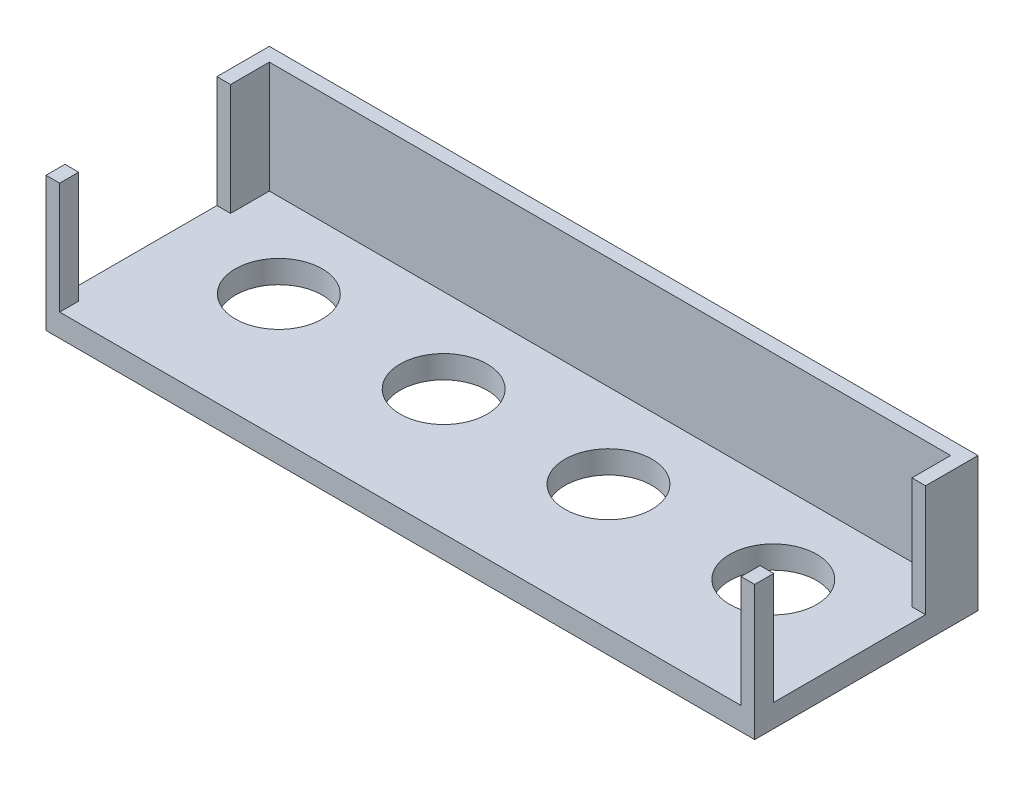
ISO-10303-21;
HEADER;
FILE_DESCRIPTION(('STEP AP214'),'2;1');
FILE_NAME('part.step','',(''),(''),'','','');
FILE_SCHEMA(('AUTOMOTIVE_DESIGN { 1 0 10303 214 1 1 1 1 }'));
ENDSEC;
DATA;
#1=APPLICATION_CONTEXT('core data for automotive mechanical design processes');
#2=APPLICATION_PROTOCOL_DEFINITION('international standard','automotive_design',2000,#1);
#3=PRODUCT_CONTEXT('',#1,'mechanical');
#4=PRODUCT('Part','Part','',(#3));
#5=PRODUCT_RELATED_PRODUCT_CATEGORY('part','',(#4));
#6=PRODUCT_DEFINITION_FORMATION('','',#4);
#7=PRODUCT_DEFINITION_CONTEXT('part definition',#1,'design');
#8=PRODUCT_DEFINITION('design','',#6,#7);
#9=PRODUCT_DEFINITION_SHAPE('','',#8);
#10=(LENGTH_UNIT() NAMED_UNIT(*) SI_UNIT(.MILLI.,.METRE.));
#11=(NAMED_UNIT(*) PLANE_ANGLE_UNIT() SI_UNIT($,.RADIAN.));
#12=(NAMED_UNIT(*) SI_UNIT($,.STERADIAN.) SOLID_ANGLE_UNIT());
#13=UNCERTAINTY_MEASURE_WITH_UNIT(LENGTH_MEASURE(1.E-05),#10,'distance_accuracy_value','');
#14=(GEOMETRIC_REPRESENTATION_CONTEXT(3) GLOBAL_UNCERTAINTY_ASSIGNED_CONTEXT((#13)) GLOBAL_UNIT_ASSIGNED_CONTEXT((#10,
#11,#12)) REPRESENTATION_CONTEXT('',''));
#15=CARTESIAN_POINT('',(0.,0.,0.));
#16=DIRECTION('',(0.,0.,1.));
#17=DIRECTION('',(1.,0.,0.));
#18=AXIS2_PLACEMENT_3D('',#15,#16,#17);
#19=CARTESIAN_POINT('',(0.,17.7,0.));
#20=DIRECTION('',(0.,-1.,0.));
#21=DIRECTION('',(0.,0.,-1.));
#22=AXIS2_PLACEMENT_3D('',#19,#20,#21);
#23=PLANE('',#22);
#24=DIRECTION('',(0.,0.,1.));
#25=VECTOR('',#24,1.);
#26=CARTESIAN_POINT('',(-0.200000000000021,17.7,-55.));
#27=LINE('',#26,#25);
#28=CARTESIAN_POINT('',(-0.20000000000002,17.7,-29.9));
#29=VERTEX_POINT('',#28);
#30=CARTESIAN_POINT('',(-0.20000000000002,17.7,-27.4));
#31=VERTEX_POINT('',#30);
#32=EDGE_CURVE('E347',#29,#31,#27,.T.);
#33=ORIENTED_EDGE('',*,*,#32,.F.);
#34=DIRECTION('',(-1.,0.,0.));
#35=VECTOR('',#34,1.);
#36=CARTESIAN_POINT('',(0.,17.7,-29.9));
#37=LINE('',#36,#35);
#38=CARTESIAN_POINT('',(-2.00000000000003,17.7,-29.9));
#39=VERTEX_POINT('',#38);
#40=EDGE_CURVE('E324',#29,#39,#37,.T.);
#41=ORIENTED_EDGE('',*,*,#40,.T.);
#42=DIRECTION('',(0.,0.,1.));
#43=VECTOR('',#42,1.);
#44=CARTESIAN_POINT('',(-2.00000000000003,17.7,-56.8));
#45=LINE('',#44,#43);
#46=CARTESIAN_POINT('',(-2.00000000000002,17.7,-27.4));
#47=VERTEX_POINT('',#46);
#48=EDGE_CURVE('E195',#39,#47,#45,.T.);
#49=ORIENTED_EDGE('',*,*,#48,.T.);
#50=DIRECTION('',(-1.,0.,0.));
#51=VECTOR('',#50,1.);
#52=CARTESIAN_POINT('',(-2.00000000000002,17.7,-27.4));
#53=LINE('',#52,#51);
#54=EDGE_CURVE('E277',#31,#47,#53,.T.);
#55=ORIENTED_EDGE('',*,*,#54,.F.);
#56=EDGE_LOOP('',(#33,#41,#49,#55));
#57=FACE_BOUND('',#56,.T.);
#58=ADVANCED_FACE('F45',(#57),#23,.F.);
#59=DIRECTION('',(0.,0.,-1.));
#60=VECTOR('',#59,1.);
#61=CARTESIAN_POINT('',(91.3,17.7,-56.8));
#62=LINE('',#61,#60);
#63=CARTESIAN_POINT('',(91.3,17.7,-27.4));
#64=VERTEX_POINT('',#63);
#65=CARTESIAN_POINT('',(91.3,17.7,-29.9));
#66=VERTEX_POINT('',#65);
#67=EDGE_CURVE('E189',#64,#66,#62,.T.);
#68=ORIENTED_EDGE('',*,*,#67,.T.);
#69=CARTESIAN_POINT('',(89.5,17.7,-29.9));
#70=VERTEX_POINT('',#69);
#71=EDGE_CURVE('E268',#66,#70,#37,.T.);
#72=ORIENTED_EDGE('',*,*,#71,.T.);
#73=DIRECTION('',(0.,0.,-1.));
#74=VECTOR('',#73,1.);
#75=CARTESIAN_POINT('',(89.5,17.7,-55.));
#76=LINE('',#75,#74);
#77=CARTESIAN_POINT('',(89.5,17.7,-27.4));
#78=VERTEX_POINT('',#77);
#79=EDGE_CURVE('E256',#78,#70,#76,.T.);
#80=ORIENTED_EDGE('',*,*,#79,.F.);
#81=EDGE_CURVE('E265',#64,#78,#53,.T.);
#82=ORIENTED_EDGE('',*,*,#81,.F.);
#83=EDGE_LOOP('',(#68,#72,#80,#82));
#84=FACE_BOUND('',#83,.T.);
#85=ADVANCED_FACE('F264',(#84),#23,.F.);
#86=CARTESIAN_POINT('',(-0.200000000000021,-90.909158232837,-55.));
#87=DIRECTION('',(-1.,0.,0.));
#88=DIRECTION('',(0.,0.,1.));
#89=AXIS2_PLACEMENT_3D('',#86,#87,#88);
#90=PLANE('',#89);
#91=DIRECTION('',(0.,1.,0.));
#92=VECTOR('',#91,1.);
#93=CARTESIAN_POINT('',(-0.20000000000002,3.,-29.9));
#94=LINE('',#93,#92);
#95=CARTESIAN_POINT('',(-0.20000000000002,3.,-29.9));
#96=VERTEX_POINT('',#95);
#97=EDGE_CURVE('E61',#96,#29,#94,.T.);
#98=ORIENTED_EDGE('',*,*,#97,.T.);
#99=ORIENTED_EDGE('',*,*,#32,.T.);
#100=DIRECTION('',(0.,-1.,0.));
#101=VECTOR('',#100,1.);
#102=CARTESIAN_POINT('',(-0.20000000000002,17.7,-27.4));
#103=LINE('',#102,#101);
#104=CARTESIAN_POINT('',(-0.20000000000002,3.,-27.4));
#105=VERTEX_POINT('',#104);
#106=EDGE_CURVE('E11',#31,#105,#103,.T.);
#107=ORIENTED_EDGE('',*,*,#106,.T.);
#108=DIRECTION('',(0.,0.,1.));
#109=VECTOR('',#108,1.);
#110=CARTESIAN_POINT('',(-0.200000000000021,3.,-55.));
#111=LINE('',#110,#109);
#112=EDGE_CURVE('E270',#96,#105,#111,.T.);
#113=ORIENTED_EDGE('',*,*,#112,.F.);
#114=EDGE_LOOP('',(#98,#99,#107,#113));
#115=FACE_BOUND('',#114,.T.);
#116=ADVANCED_FACE('F402',(#115),#90,.F.);
#117=CARTESIAN_POINT('',(89.5,-90.909158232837,-55.));
#118=DIRECTION('',(1.,0.,0.));
#119=DIRECTION('',(0.,0.,-1.));
#120=AXIS2_PLACEMENT_3D('',#117,#118,#119);
#121=PLANE('',#120);
#122=ORIENTED_EDGE('',*,*,#79,.T.);
#123=DIRECTION('',(0.,-1.,0.));
#124=VECTOR('',#123,1.);
#125=CARTESIAN_POINT('',(89.5,3.,-29.9));
#126=LINE('',#125,#124);
#127=CARTESIAN_POINT('',(89.5,3.,-29.9));
#128=VERTEX_POINT('',#127);
#129=EDGE_CURVE('E335',#70,#128,#126,.T.);
#130=ORIENTED_EDGE('',*,*,#129,.T.);
#131=DIRECTION('',(0.,0.,-1.));
#132=VECTOR('',#131,1.);
#133=CARTESIAN_POINT('',(89.5,3.,-55.));
#134=LINE('',#133,#132);
#135=CARTESIAN_POINT('',(89.5,3.,-27.4));
#136=VERTEX_POINT('',#135);
#137=EDGE_CURVE('E258',#136,#128,#134,.T.);
#138=ORIENTED_EDGE('',*,*,#137,.F.);
#139=DIRECTION('',(0.,1.,0.));
#140=VECTOR('',#139,1.);
#141=CARTESIAN_POINT('',(89.5,17.7,-27.4));
#142=LINE('',#141,#140);
#143=EDGE_CURVE('E54',#136,#78,#142,.T.);
#144=ORIENTED_EDGE('',*,*,#143,.T.);
#145=EDGE_LOOP('',(#122,#130,#138,#144));
#146=FACE_BOUND('',#145,.T.);
#147=ADVANCED_FACE('F255',(#146),#121,.F.);
#148=CARTESIAN_POINT('',(-2.00000000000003,17.7,-56.8));
#149=DIRECTION('',(1.,0.,0.));
#150=DIRECTION('',(0.,0.,-1.));
#151=AXIS2_PLACEMENT_3D('',#148,#149,#150);
#152=PLANE('',#151);
#153=ORIENTED_EDGE('',*,*,#48,.F.);
#154=DIRECTION('',(0.,-1.,0.));
#155=VECTOR('',#154,1.);
#156=CARTESIAN_POINT('',(-2.00000000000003,3.,-29.9));
#157=LINE('',#156,#155);
#158=CARTESIAN_POINT('',(-2.00000000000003,3.,-29.9));
#159=VERTEX_POINT('',#158);
#160=EDGE_CURVE('E295',#39,#159,#157,.T.);
#161=ORIENTED_EDGE('',*,*,#160,.T.);
#162=DIRECTION('',(0.,0.,-1.));
#163=VECTOR('',#162,1.);
#164=CARTESIAN_POINT('',(-2.00000000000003,3.,-29.9));
#165=LINE('',#164,#163);
#166=CARTESIAN_POINT('',(-2.00000000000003,3.,-49.9));
#167=VERTEX_POINT('',#166);
#168=EDGE_CURVE('E299',#159,#167,#165,.T.);
#169=ORIENTED_EDGE('',*,*,#168,.T.);
#170=DIRECTION('',(0.,1.,0.));
#171=VECTOR('',#170,1.);
#172=CARTESIAN_POINT('',(-2.00000000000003,3.,-49.9));
#173=LINE('',#172,#171);
#174=CARTESIAN_POINT('',(-2.00000000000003,17.7,-49.9));
#175=VERTEX_POINT('',#174);
#176=EDGE_CURVE('E303',#167,#175,#173,.T.);
#177=ORIENTED_EDGE('',*,*,#176,.T.);
#178=CARTESIAN_POINT('',(-2.00000000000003,17.7,-56.8));
#179=VERTEX_POINT('',#178);
#180=EDGE_CURVE('E190',#179,#175,#45,.T.);
#181=ORIENTED_EDGE('',*,*,#180,.F.);
#182=DIRECTION('',(0.,-1.,0.));
#183=VECTOR('',#182,1.);
#184=CARTESIAN_POINT('',(-2.00000000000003,17.7,-56.8));
#185=LINE('',#184,#183);
#186=CARTESIAN_POINT('',(-2.00000000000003,0.,-56.8));
#187=VERTEX_POINT('',#186);
#188=EDGE_CURVE('E214',#179,#187,#185,.T.);
#189=ORIENTED_EDGE('',*,*,#188,.T.);
#190=DIRECTION('',(0.,0.,1.));
#191=VECTOR('',#190,1.);
#192=CARTESIAN_POINT('',(-2.00000000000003,0.,-56.8));
#193=LINE('',#192,#191);
#194=CARTESIAN_POINT('',(-2.00000000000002,0.,-27.4));
#195=VERTEX_POINT('',#194);
#196=EDGE_CURVE('E203',#187,#195,#193,.T.);
#197=ORIENTED_EDGE('',*,*,#196,.T.);
#198=DIRECTION('',(0.,-1.,0.));
#199=VECTOR('',#198,1.);
#200=CARTESIAN_POINT('',(-2.00000000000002,17.7,-27.4));
#201=LINE('',#200,#199);
#202=EDGE_CURVE('E276',#47,#195,#201,.T.);
#203=ORIENTED_EDGE('',*,*,#202,.F.);
#204=EDGE_LOOP('',(#153,#161,#169,#177,#181,#189,#197,#203));
#205=FACE_BOUND('',#204,.T.);
#206=ADVANCED_FACE('F328',(#205),#152,.F.);
#207=CARTESIAN_POINT('',(91.3,17.7,-56.8));
#208=DIRECTION('',(-1.,0.,0.));
#209=DIRECTION('',(0.,0.,1.));
#210=AXIS2_PLACEMENT_3D('',#207,#208,#209);
#211=PLANE('',#210);
#212=DIRECTION('',(0.,-1.,0.));
#213=VECTOR('',#212,1.);
#214=CARTESIAN_POINT('',(91.3,3.,-29.9));
#215=LINE('',#214,#213);
#216=CARTESIAN_POINT('',(91.3,3.,-29.9));
#217=VERTEX_POINT('',#216);
#218=EDGE_CURVE('E306',#66,#217,#215,.T.);
#219=ORIENTED_EDGE('',*,*,#218,.F.);
#220=ORIENTED_EDGE('',*,*,#67,.F.);
#221=DIRECTION('',(0.,-1.,0.));
#222=VECTOR('',#221,1.);
#223=CARTESIAN_POINT('',(91.3,17.7,-27.4));
#224=LINE('',#223,#222);
#225=CARTESIAN_POINT('',(91.3,0.,-27.4));
#226=VERTEX_POINT('',#225);
#227=EDGE_CURVE('E274',#64,#226,#224,.T.);
#228=ORIENTED_EDGE('',*,*,#227,.T.);
#229=DIRECTION('',(0.,0.,-1.));
#230=VECTOR('',#229,1.);
#231=CARTESIAN_POINT('',(91.3,0.,-56.8));
#232=LINE('',#231,#230);
#233=CARTESIAN_POINT('',(91.3,0.,-56.8));
#234=VERTEX_POINT('',#233);
#235=EDGE_CURVE('E208',#226,#234,#232,.T.);
#236=ORIENTED_EDGE('',*,*,#235,.T.);
#237=DIRECTION('',(0.,-1.,0.));
#238=VECTOR('',#237,1.);
#239=CARTESIAN_POINT('',(91.3,17.7,-56.8));
#240=LINE('',#239,#238);
#241=CARTESIAN_POINT('',(91.3,17.7,-56.8));
#242=VERTEX_POINT('',#241);
#243=EDGE_CURVE('E186',#242,#234,#240,.T.);
#244=ORIENTED_EDGE('',*,*,#243,.F.);
#245=CARTESIAN_POINT('',(91.3,17.7,-49.9));
#246=VERTEX_POINT('',#245);
#247=EDGE_CURVE('E177',#246,#242,#62,.T.);
#248=ORIENTED_EDGE('',*,*,#247,.F.);
#249=DIRECTION('',(0.,1.,0.));
#250=VECTOR('',#249,1.);
#251=CARTESIAN_POINT('',(91.3,3.,-49.9));
#252=LINE('',#251,#250);
#253=CARTESIAN_POINT('',(91.3,3.,-49.9));
#254=VERTEX_POINT('',#253);
#255=EDGE_CURVE('E159',#254,#246,#252,.T.);
#256=ORIENTED_EDGE('',*,*,#255,.F.);
#257=DIRECTION('',(0.,0.,-1.));
#258=VECTOR('',#257,1.);
#259=CARTESIAN_POINT('',(91.3,3.,-29.9));
#260=LINE('',#259,#258);
#261=EDGE_CURVE('E171',#217,#254,#260,.T.);
#262=ORIENTED_EDGE('',*,*,#261,.F.);
#263=EDGE_LOOP('',(#219,#220,#228,#236,#244,#248,#256,#262));
#264=FACE_BOUND('',#263,.T.);
#265=ADVANCED_FACE('F184',(#264),#211,.F.);
#266=CARTESIAN_POINT('',(0.,3.,0.));
#267=DIRECTION('',(0.,-1.,0.));
#268=DIRECTION('',(0.,0.,-1.));
#269=AXIS2_PLACEMENT_3D('',#266,#267,#268);
#270=PLANE('',#269);
#271=ORIENTED_EDGE('',*,*,#112,.T.);
#272=DIRECTION('',(-1.,0.,0.));
#273=VECTOR('',#272,1.);
#274=CARTESIAN_POINT('',(0.,3.,-27.4));
#275=LINE('',#274,#273);
#276=EDGE_CURVE('E292',#136,#105,#275,.T.);
#277=ORIENTED_EDGE('',*,*,#276,.F.);
#278=ORIENTED_EDGE('',*,*,#137,.T.);
#279=DIRECTION('',(-1.,0.,0.));
#280=VECTOR('',#279,1.);
#281=CARTESIAN_POINT('',(91.3,3.,-29.9));
#282=LINE('',#281,#280);
#283=EDGE_CURVE('E204',#217,#128,#282,.T.);
#284=ORIENTED_EDGE('',*,*,#283,.F.);
#285=ORIENTED_EDGE('',*,*,#261,.T.);
#286=DIRECTION('',(-1.,0.,0.));
#287=VECTOR('',#286,1.);
#288=CARTESIAN_POINT('',(91.3,3.,-49.9));
#289=LINE('',#288,#287);
#290=CARTESIAN_POINT('',(89.5,3.,-49.9));
#291=VERTEX_POINT('',#290);
#292=EDGE_CURVE('E165',#254,#291,#289,.T.);
#293=ORIENTED_EDGE('',*,*,#292,.T.);
#294=CARTESIAN_POINT('',(89.5,3.,-55.));
#295=VERTEX_POINT('',#294);
#296=EDGE_CURVE('E355',#291,#295,#134,.T.);
#297=ORIENTED_EDGE('',*,*,#296,.T.);
#298=DIRECTION('',(-1.,0.,0.));
#299=VECTOR('',#298,1.);
#300=CARTESIAN_POINT('',(89.5,3.,-55.));
#301=LINE('',#300,#299);
#302=CARTESIAN_POINT('',(-0.200000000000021,3.,-55.));
#303=VERTEX_POINT('',#302);
#304=EDGE_CURVE('E356',#295,#303,#301,.T.);
#305=ORIENTED_EDGE('',*,*,#304,.T.);
#306=CARTESIAN_POINT('',(-0.200000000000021,3.,-49.9));
#307=VERTEX_POINT('',#306);
#308=EDGE_CURVE('E351',#303,#307,#111,.T.);
#309=ORIENTED_EDGE('',*,*,#308,.T.);
#310=EDGE_CURVE('E170',#307,#167,#289,.T.);
#311=ORIENTED_EDGE('',*,*,#310,.T.);
#312=ORIENTED_EDGE('',*,*,#168,.F.);
#313=EDGE_CURVE('E313',#96,#159,#282,.T.);
#314=ORIENTED_EDGE('',*,*,#313,.F.);
#315=EDGE_LOOP('',(#271,#277,#278,#284,#285,#293,#297,#305,#309,#311,#312,#314));
#316=FACE_BOUND('',#315,.T.);
#317=CARTESIAN_POINT('',(77.25,3.,-43.9));
#318=DIRECTION('',(0.,1.,0.));
#319=DIRECTION('',(0.,0.,1.));
#320=AXIS2_PLACEMENT_3D('',#317,#318,#319);
#321=CIRCLE('',#320,5.72499999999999);
#322=CARTESIAN_POINT('',(77.25,3.,-38.175));
#323=VERTEX_POINT('',#322);
#324=EDGE_CURVE('E219',#323,#323,#321,.T.);
#325=ORIENTED_EDGE('',*,*,#324,.F.);
#326=EDGE_LOOP('',(#325));
#327=FACE_BOUND('',#326,.T.);
#328=CARTESIAN_POINT('',(55.55,3.,-43.9));
#329=DIRECTION('',(0.,1.,0.));
#330=DIRECTION('',(0.,0.,1.));
#331=AXIS2_PLACEMENT_3D('',#328,#329,#330);
#332=CIRCLE('',#331,5.725);
#333=CARTESIAN_POINT('',(55.55,3.,-38.175));
#334=VERTEX_POINT('',#333);
#335=EDGE_CURVE('E227',#334,#334,#332,.T.);
#336=ORIENTED_EDGE('',*,*,#335,.F.);
#337=EDGE_LOOP('',(#336));
#338=FACE_BOUND('',#337,.T.);
#339=CARTESIAN_POINT('',(33.85,3.,-43.9));
#340=DIRECTION('',(0.,1.,0.));
#341=DIRECTION('',(0.,0.,1.));
#342=AXIS2_PLACEMENT_3D('',#339,#340,#341);
#343=CIRCLE('',#342,5.725);
#344=CARTESIAN_POINT('',(33.85,3.,-38.175));
#345=VERTEX_POINT('',#344);
#346=EDGE_CURVE('E235',#345,#345,#343,.T.);
#347=ORIENTED_EDGE('',*,*,#346,.F.);
#348=EDGE_LOOP('',(#347));
#349=FACE_BOUND('',#348,.T.);
#350=CARTESIAN_POINT('',(12.15,3.,-43.9));
#351=DIRECTION('',(0.,1.,0.));
#352=DIRECTION('',(0.,0.,1.));
#353=AXIS2_PLACEMENT_3D('',#350,#351,#352);
#354=CIRCLE('',#353,5.725);
#355=CARTESIAN_POINT('',(12.15,3.,-38.175));
#356=VERTEX_POINT('',#355);
#357=EDGE_CURVE('E243',#356,#356,#354,.T.);
#358=ORIENTED_EDGE('',*,*,#357,.F.);
#359=EDGE_LOOP('',(#358));
#360=FACE_BOUND('',#359,.T.);
#361=ADVANCED_FACE('F383',(#316,#327,#338,#349,#360),#270,.F.);
#362=CARTESIAN_POINT('',(0.,0.,0.));
#363=DIRECTION('',(0.,-1.,0.));
#364=DIRECTION('',(0.,0.,-1.));
#365=AXIS2_PLACEMENT_3D('',#362,#363,#364);
#366=PLANE('',#365);
#367=CARTESIAN_POINT('',(55.55,0.,-43.9));
#368=DIRECTION('',(0.,1.,0.));
#369=DIRECTION('',(0.,0.,1.));
#370=AXIS2_PLACEMENT_3D('',#367,#368,#369);
#371=CIRCLE('',#370,5.725);
#372=CARTESIAN_POINT('',(55.55,0.,-38.175));
#373=VERTEX_POINT('',#372);
#374=EDGE_CURVE('E223',#373,#373,#371,.T.);
#375=ORIENTED_EDGE('',*,*,#374,.T.);
#376=EDGE_LOOP('',(#375));
#377=FACE_BOUND('',#376,.T.);
#378=CARTESIAN_POINT('',(12.15,0.,-43.9));
#379=DIRECTION('',(0.,1.,0.));
#380=DIRECTION('',(0.,0.,1.));
#381=AXIS2_PLACEMENT_3D('',#378,#379,#380);
#382=CIRCLE('',#381,5.725);
#383=CARTESIAN_POINT('',(12.15,0.,-38.175));
#384=VERTEX_POINT('',#383);
#385=EDGE_CURVE('E239',#384,#384,#382,.T.);
#386=ORIENTED_EDGE('',*,*,#385,.T.);
#387=EDGE_LOOP('',(#386));
#388=FACE_BOUND('',#387,.T.);
#389=CARTESIAN_POINT('',(33.85,0.,-43.9));
#390=DIRECTION('',(0.,1.,0.));
#391=DIRECTION('',(0.,0.,1.));
#392=AXIS2_PLACEMENT_3D('',#389,#390,#391);
#393=CIRCLE('',#392,5.725);
#394=CARTESIAN_POINT('',(33.85,0.,-38.175));
#395=VERTEX_POINT('',#394);
#396=EDGE_CURVE('E231',#395,#395,#393,.T.);
#397=ORIENTED_EDGE('',*,*,#396,.T.);
#398=EDGE_LOOP('',(#397));
#399=FACE_BOUND('',#398,.T.);
#400=CARTESIAN_POINT('',(77.25,0.,-43.9));
#401=DIRECTION('',(0.,1.,0.));
#402=DIRECTION('',(0.,0.,1.));
#403=AXIS2_PLACEMENT_3D('',#400,#401,#402);
#404=CIRCLE('',#403,5.72499999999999);
#405=CARTESIAN_POINT('',(77.25,0.,-38.175));
#406=VERTEX_POINT('',#405);
#407=EDGE_CURVE('E218',#406,#406,#404,.T.);
#408=ORIENTED_EDGE('',*,*,#407,.T.);
#409=EDGE_LOOP('',(#408));
#410=FACE_BOUND('',#409,.T.);
#411=ORIENTED_EDGE('',*,*,#235,.F.);
#412=DIRECTION('',(-1.,0.,0.));
#413=VECTOR('',#412,1.);
#414=CARTESIAN_POINT('',(-2.00000000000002,0.,-27.4));
#415=LINE('',#414,#413);
#416=EDGE_CURVE('E283',#226,#195,#415,.T.);
#417=ORIENTED_EDGE('',*,*,#416,.T.);
#418=ORIENTED_EDGE('',*,*,#196,.F.);
#419=DIRECTION('',(-1.,0.,0.));
#420=VECTOR('',#419,1.);
#421=CARTESIAN_POINT('',(-2.00000000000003,0.,-56.8));
#422=LINE('',#421,#420);
#423=EDGE_CURVE('E199',#234,#187,#422,.T.);
#424=ORIENTED_EDGE('',*,*,#423,.F.);
#425=EDGE_LOOP('',(#411,#417,#418,#424));
#426=FACE_BOUND('',#425,.T.);
#427=ADVANCED_FACE('F47',(#377,#388,#399,#410,#426),#366,.T.);
#428=ORIENTED_EDGE('',*,*,#180,.T.);
#429=DIRECTION('',(1.,0.,0.));
#430=VECTOR('',#429,1.);
#431=CARTESIAN_POINT('',(0.,17.7,-49.9));
#432=LINE('',#431,#430);
#433=CARTESIAN_POINT('',(-0.200000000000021,17.7,-49.9));
#434=VERTEX_POINT('',#433);
#435=EDGE_CURVE('E182',#175,#434,#432,.T.);
#436=ORIENTED_EDGE('',*,*,#435,.T.);
#437=CARTESIAN_POINT('',(-0.200000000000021,17.7,-55.));
#438=VERTEX_POINT('',#437);
#439=EDGE_CURVE('E343',#438,#434,#27,.T.);
#440=ORIENTED_EDGE('',*,*,#439,.F.);
#441=DIRECTION('',(-1.,0.,0.));
#442=VECTOR('',#441,1.);
#443=CARTESIAN_POINT('',(89.5,17.7,-55.));
#444=LINE('',#443,#442);
#445=CARTESIAN_POINT('',(89.5,17.7,-55.));
#446=VERTEX_POINT('',#445);
#447=EDGE_CURVE('E340',#446,#438,#444,.T.);
#448=ORIENTED_EDGE('',*,*,#447,.F.);
#449=CARTESIAN_POINT('',(89.5,17.7,-49.9));
#450=VERTEX_POINT('',#449);
#451=EDGE_CURVE('E180',#450,#446,#76,.T.);
#452=ORIENTED_EDGE('',*,*,#451,.F.);
#453=EDGE_CURVE('E162',#450,#246,#432,.T.);
#454=ORIENTED_EDGE('',*,*,#453,.T.);
#455=ORIENTED_EDGE('',*,*,#247,.T.);
#456=DIRECTION('',(-1.,0.,0.));
#457=VECTOR('',#456,1.);
#458=CARTESIAN_POINT('',(-2.00000000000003,17.7,-56.8));
#459=LINE('',#458,#457);
#460=EDGE_CURVE('E211',#242,#179,#459,.T.);
#461=ORIENTED_EDGE('',*,*,#460,.T.);
#462=EDGE_LOOP('',(#428,#436,#440,#448,#452,#454,#455,#461));
#463=FACE_BOUND('',#462,.T.);
#464=ADVANCED_FACE('F175',(#463),#23,.F.);
#465=CARTESIAN_POINT('',(12.15,3.,-43.9));
#466=DIRECTION('',(0.,-1.,0.));
#467=DIRECTION('',(0.,0.,-1.));
#468=AXIS2_PLACEMENT_3D('',#465,#466,#467);
#469=CYLINDRICAL_SURFACE('',#468,5.725);
#470=ORIENTED_EDGE('',*,*,#357,.T.);
#471=EDGE_LOOP('',(#470));
#472=FACE_BOUND('',#471,.T.);
#473=ORIENTED_EDGE('',*,*,#385,.F.);
#474=EDGE_LOOP('',(#473));
#475=FACE_BOUND('',#474,.T.);
#476=ADVANCED_FACE('F421',(#472,#475),#469,.F.);
#477=CARTESIAN_POINT('',(33.85,3.,-43.9));
#478=DIRECTION('',(0.,-1.,0.));
#479=DIRECTION('',(0.,0.,-1.));
#480=AXIS2_PLACEMENT_3D('',#477,#478,#479);
#481=CYLINDRICAL_SURFACE('',#480,5.725);
#482=ORIENTED_EDGE('',*,*,#346,.T.);
#483=EDGE_LOOP('',(#482));
#484=FACE_BOUND('',#483,.T.);
#485=ORIENTED_EDGE('',*,*,#396,.F.);
#486=EDGE_LOOP('',(#485));
#487=FACE_BOUND('',#486,.T.);
#488=ADVANCED_FACE('F427',(#484,#487),#481,.F.);
#489=CARTESIAN_POINT('',(55.55,3.,-43.9));
#490=DIRECTION('',(0.,-1.,0.));
#491=DIRECTION('',(0.,0.,-1.));
#492=AXIS2_PLACEMENT_3D('',#489,#490,#491);
#493=CYLINDRICAL_SURFACE('',#492,5.725);
#494=ORIENTED_EDGE('',*,*,#335,.T.);
#495=EDGE_LOOP('',(#494));
#496=FACE_BOUND('',#495,.T.);
#497=ORIENTED_EDGE('',*,*,#374,.F.);
#498=EDGE_LOOP('',(#497));
#499=FACE_BOUND('',#498,.T.);
#500=ADVANCED_FACE('F447',(#496,#499),#493,.F.);
#501=CARTESIAN_POINT('',(77.25,3.,-43.9));
#502=DIRECTION('',(0.,-1.,0.));
#503=DIRECTION('',(0.,0.,-1.));
#504=AXIS2_PLACEMENT_3D('',#501,#502,#503);
#505=CYLINDRICAL_SURFACE('',#504,5.72499999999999);
#506=ORIENTED_EDGE('',*,*,#324,.T.);
#507=EDGE_LOOP('',(#506));
#508=FACE_BOUND('',#507,.T.);
#509=ORIENTED_EDGE('',*,*,#407,.F.);
#510=EDGE_LOOP('',(#509));
#511=FACE_BOUND('',#510,.T.);
#512=ADVANCED_FACE('F444',(#508,#511),#505,.F.);
#513=CARTESIAN_POINT('',(-2.00000000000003,17.7,-56.8));
#514=DIRECTION('',(0.,0.,1.));
#515=DIRECTION('',(1.,0.,0.));
#516=AXIS2_PLACEMENT_3D('',#513,#514,#515);
#517=PLANE('',#516);
#518=ORIENTED_EDGE('',*,*,#423,.T.);
#519=ORIENTED_EDGE('',*,*,#188,.F.);
#520=ORIENTED_EDGE('',*,*,#460,.F.);
#521=ORIENTED_EDGE('',*,*,#243,.T.);
#522=EDGE_LOOP('',(#518,#519,#520,#521));
#523=FACE_BOUND('',#522,.T.);
#524=ADVANCED_FACE('F446',(#523),#517,.F.);
#525=CARTESIAN_POINT('',(91.3,3.,-49.9));
#526=DIRECTION('',(0.,0.,1.));
#527=DIRECTION('',(1.,0.,0.));
#528=AXIS2_PLACEMENT_3D('',#525,#526,#527);
#529=PLANE('',#528);
#530=DIRECTION('',(0.,1.,0.));
#531=VECTOR('',#530,1.);
#532=CARTESIAN_POINT('',(89.5,3.,-49.9));
#533=LINE('',#532,#531);
#534=EDGE_CURVE('E69',#291,#450,#533,.T.);
#535=ORIENTED_EDGE('',*,*,#534,.F.);
#536=ORIENTED_EDGE('',*,*,#292,.F.);
#537=ORIENTED_EDGE('',*,*,#255,.T.);
#538=ORIENTED_EDGE('',*,*,#453,.F.);
#539=EDGE_LOOP('',(#535,#536,#537,#538));
#540=FACE_BOUND('',#539,.T.);
#541=ADVANCED_FACE('F161',(#540),#529,.T.);
#542=CARTESIAN_POINT('',(91.3,3.,-29.9));
#543=DIRECTION('',(0.,0.,-1.));
#544=DIRECTION('',(-1.,0.,0.));
#545=AXIS2_PLACEMENT_3D('',#542,#543,#544);
#546=PLANE('',#545);
#547=ORIENTED_EDGE('',*,*,#129,.F.);
#548=ORIENTED_EDGE('',*,*,#71,.F.);
#549=ORIENTED_EDGE('',*,*,#218,.T.);
#550=ORIENTED_EDGE('',*,*,#283,.T.);
#551=EDGE_LOOP('',(#547,#548,#549,#550));
#552=FACE_BOUND('',#551,.T.);
#553=ADVANCED_FACE('F334',(#552),#546,.T.);
#554=ORIENTED_EDGE('',*,*,#97,.F.);
#555=ORIENTED_EDGE('',*,*,#313,.T.);
#556=ORIENTED_EDGE('',*,*,#160,.F.);
#557=ORIENTED_EDGE('',*,*,#40,.F.);
#558=EDGE_LOOP('',(#554,#555,#556,#557));
#559=FACE_BOUND('',#558,.T.);
#560=ADVANCED_FACE('F394',(#559),#546,.T.);
#561=DIRECTION('',(0.,-1.,0.));
#562=VECTOR('',#561,1.);
#563=CARTESIAN_POINT('',(-0.20000000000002,3.,-49.9));
#564=LINE('',#563,#562);
#565=EDGE_CURVE('E372',#434,#307,#564,.T.);
#566=ORIENTED_EDGE('',*,*,#565,.F.);
#567=ORIENTED_EDGE('',*,*,#435,.F.);
#568=ORIENTED_EDGE('',*,*,#176,.F.);
#569=ORIENTED_EDGE('',*,*,#310,.F.);
#570=EDGE_LOOP('',(#566,#567,#568,#569));
#571=FACE_BOUND('',#570,.T.);
#572=ADVANCED_FACE('F389',(#571),#529,.T.);
#573=CARTESIAN_POINT('',(-2.00000000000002,17.7,-27.4));
#574=DIRECTION('',(0.,0.,1.));
#575=DIRECTION('',(1.,0.,0.));
#576=AXIS2_PLACEMENT_3D('',#573,#574,#575);
#577=PLANE('',#576);
#578=ORIENTED_EDGE('',*,*,#276,.T.);
#579=ORIENTED_EDGE('',*,*,#106,.F.);
#580=ORIENTED_EDGE('',*,*,#54,.T.);
#581=ORIENTED_EDGE('',*,*,#202,.T.);
#582=ORIENTED_EDGE('',*,*,#416,.F.);
#583=ORIENTED_EDGE('',*,*,#227,.F.);
#584=ORIENTED_EDGE('',*,*,#81,.T.);
#585=ORIENTED_EDGE('',*,*,#143,.F.);
#586=EDGE_LOOP('',(#578,#579,#580,#581,#582,#583,#584,#585));
#587=FACE_BOUND('',#586,.T.);
#588=ADVANCED_FACE('F272',(#587),#577,.T.);
#589=ORIENTED_EDGE('',*,*,#439,.T.);
#590=ORIENTED_EDGE('',*,*,#565,.T.);
#591=ORIENTED_EDGE('',*,*,#308,.F.);
#592=DIRECTION('',(0.,1.,0.));
#593=VECTOR('',#592,1.);
#594=CARTESIAN_POINT('',(-0.200000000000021,-90.909158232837,-55.));
#595=LINE('',#594,#593);
#596=EDGE_CURVE('E360',#303,#438,#595,.T.);
#597=ORIENTED_EDGE('',*,*,#596,.T.);
#598=EDGE_LOOP('',(#589,#590,#591,#597));
#599=FACE_BOUND('',#598,.T.);
#600=ADVANCED_FACE('F376',(#599),#90,.F.);
#601=ORIENTED_EDGE('',*,*,#534,.T.);
#602=ORIENTED_EDGE('',*,*,#451,.T.);
#603=DIRECTION('',(0.,1.,0.));
#604=VECTOR('',#603,1.);
#605=CARTESIAN_POINT('',(89.5,-90.909158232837,-55.));
#606=LINE('',#605,#604);
#607=EDGE_CURVE('E361',#295,#446,#606,.T.);
#608=ORIENTED_EDGE('',*,*,#607,.F.);
#609=ORIENTED_EDGE('',*,*,#296,.F.);
#610=EDGE_LOOP('',(#601,#602,#608,#609));
#611=FACE_BOUND('',#610,.T.);
#612=ADVANCED_FACE('F398',(#611),#121,.F.);
#613=CARTESIAN_POINT('',(89.5,-90.909158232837,-55.));
#614=DIRECTION('',(0.,0.,-1.));
#615=DIRECTION('',(-1.,0.,0.));
#616=AXIS2_PLACEMENT_3D('',#613,#614,#615);
#617=PLANE('',#616);
#618=ORIENTED_EDGE('',*,*,#607,.T.);
#619=ORIENTED_EDGE('',*,*,#447,.T.);
#620=ORIENTED_EDGE('',*,*,#596,.F.);
#621=ORIENTED_EDGE('',*,*,#304,.F.);
#622=EDGE_LOOP('',(#618,#619,#620,#621));
#623=FACE_BOUND('',#622,.T.);
#624=ADVANCED_FACE('F396',(#623),#617,.F.);
#625=CLOSED_SHELL('',(#58,#85,#116,#147,#206,#265,#361,#427,#464,#476,#488,#500,#512,#524,#541,
#553,#560,#572,#588,#600,#612,#624));
#626=MANIFOLD_SOLID_BREP('B2',#625);
#627=ADVANCED_BREP_SHAPE_REPRESENTATION('',(#18,#626),#14);
#628=SHAPE_DEFINITION_REPRESENTATION(#9,#627);
ENDSEC;
END-ISO-10303-21;
